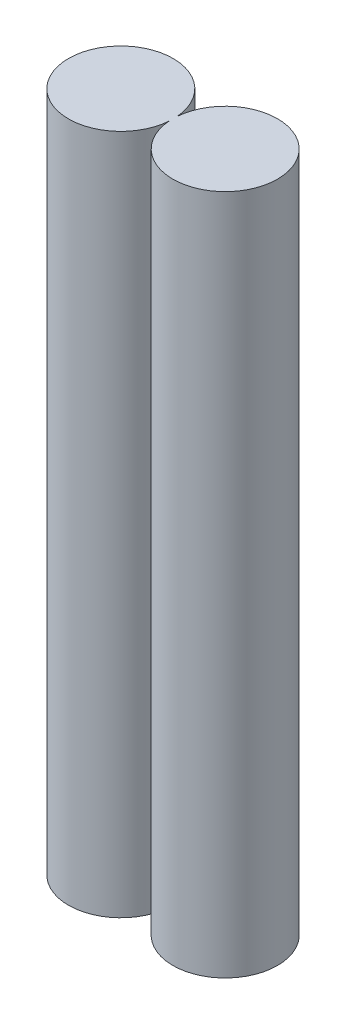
from build123d import *

# Parameters (mm, degrees)
SKETCH1_R       = 17.3228
EXTRUDE1_DEPTH  = 225.425
LPATTERN3_COUNT = 2
LPATTERN3_PITCH = 34.544


with BuildPart() as part:
    # Sketch1 → Extrude1 (new body)
    with BuildSketch(Plane(origin=(0, 0, 0), x_dir=(1, 0, 0), z_dir=(0, 1, 0))):
        with Locations(Location((0, 0, 0), (0, 0, 90))):
            Circle(SKETCH1_R)
    extrude1 = extrude(amount=EXTRUDE1_DEPTH)

    # LPattern3: Extrude1 ×2
    with Locations(*[(-i * LPATTERN3_PITCH, 0, 0) for i in range(1, LPATTERN3_COUNT)]):
        add(extrude1)


solid = part.part
